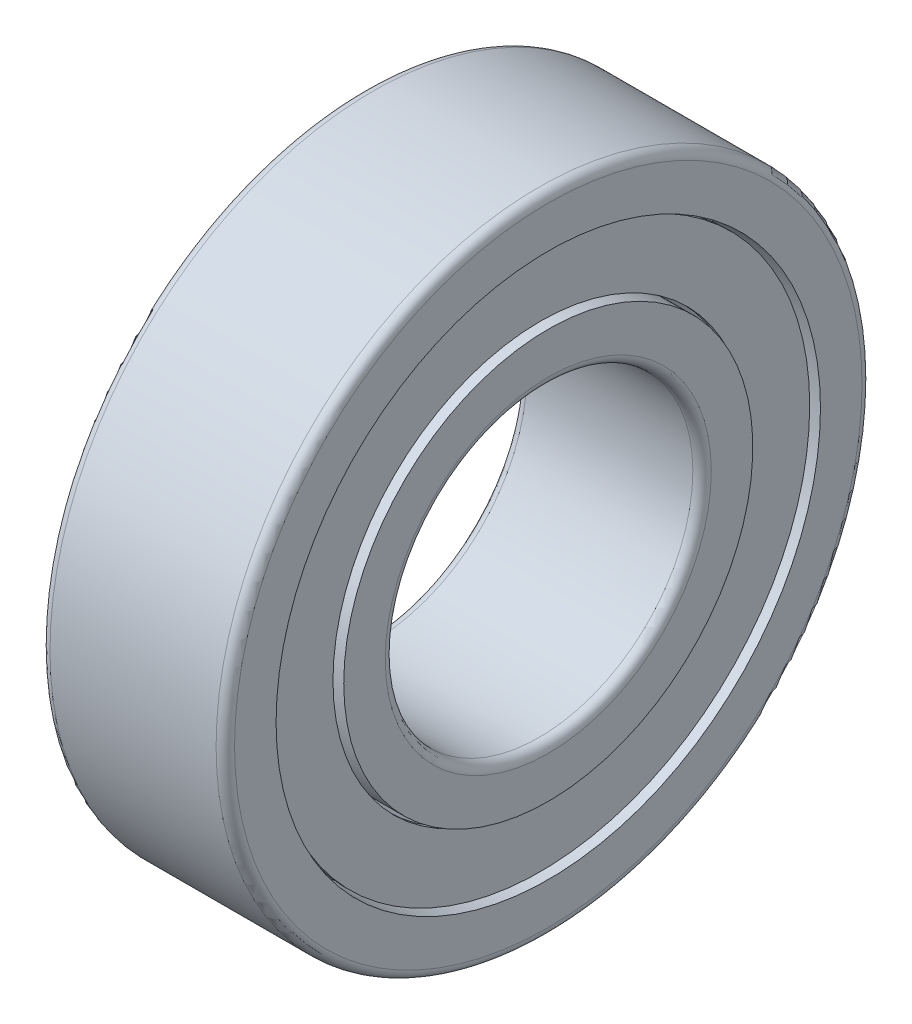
ISO-10303-21;
HEADER;
FILE_DESCRIPTION(('STEP AP214'),'2;1');
FILE_NAME('part.step','',(''),(''),'','','');
FILE_SCHEMA(('AUTOMOTIVE_DESIGN { 1 0 10303 214 1 1 1 1 }'));
ENDSEC;
DATA;
#1=APPLICATION_CONTEXT('core data for automotive mechanical design processes');
#2=APPLICATION_PROTOCOL_DEFINITION('international standard','automotive_design',2000,#1);
#3=PRODUCT_CONTEXT('',#1,'mechanical');
#4=PRODUCT('Part','Part','',(#3));
#5=PRODUCT_RELATED_PRODUCT_CATEGORY('part','',(#4));
#6=PRODUCT_DEFINITION_FORMATION('','',#4);
#7=PRODUCT_DEFINITION_CONTEXT('part definition',#1,'design');
#8=PRODUCT_DEFINITION('design','',#6,#7);
#9=PRODUCT_DEFINITION_SHAPE('','',#8);
#10=(LENGTH_UNIT() NAMED_UNIT(*) SI_UNIT(.MILLI.,.METRE.));
#11=(NAMED_UNIT(*) PLANE_ANGLE_UNIT() SI_UNIT($,.RADIAN.));
#12=(NAMED_UNIT(*) SI_UNIT($,.STERADIAN.) SOLID_ANGLE_UNIT());
#13=UNCERTAINTY_MEASURE_WITH_UNIT(LENGTH_MEASURE(1.E-05),#10,'distance_accuracy_value','');
#14=(GEOMETRIC_REPRESENTATION_CONTEXT(3) GLOBAL_UNCERTAINTY_ASSIGNED_CONTEXT((#13)) GLOBAL_UNIT_ASSIGNED_CONTEXT((#10,
#11,#12)) REPRESENTATION_CONTEXT('',''));
#15=CARTESIAN_POINT('',(0.,0.,0.));
#16=DIRECTION('',(0.,0.,1.));
#17=DIRECTION('',(1.,0.,0.));
#18=AXIS2_PLACEMENT_3D('',#15,#16,#17);
#19=CARTESIAN_POINT('',(6.00000000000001,1.80411241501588E-13,0.));
#20=DIRECTION('',(-1.,0.,0.));
#21=DIRECTION('',(0.,0.,1.00000000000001));
#22=AXIS2_PLACEMENT_3D('',#19,#20,#21);
#23=TOROIDAL_SURFACE('',#22,15.5,3.3);
#24=CARTESIAN_POINT('',(6.00000000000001,1.81454851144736E-13,18.8000000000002));
#25=VERTEX_POINT('',#24);
#26=VERTEX_LOOP('',#25);
#27=FACE_BOUND('',#26,.T.);
#28=ADVANCED_FACE('F40',(#27),#23,.T.);
#29=CLOSED_SHELL('',(#28));
#30=CARTESIAN_POINT('',(6.00000000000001,1.80411241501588E-13,0.));
#31=DIRECTION('',(-1.,0.,0.));
#32=DIRECTION('',(0.,0.,1.00000000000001));
#33=AXIS2_PLACEMENT_3D('',#30,#31,#32);
#34=TOROIDAL_SURFACE('',#33,15.5,3.25);
#35=CARTESIAN_POINT('',(6.00000000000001,1.81452075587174E-13,18.7500000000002));
#36=VERTEX_POINT('',#35);
#37=VERTEX_LOOP('',#36);
#38=FACE_BOUND('',#37,.T.);
#39=ADVANCED_FACE('F53',(#38),#34,.F.);
#40=CLOSED_SHELL('',(#39));
#41=ORIENTED_CLOSED_SHELL('',*,#40,.T.);
#42=BREP_WITH_VOIDS('B2',#29,(#41));
#43=CARTESIAN_POINT('',(0.599999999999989,0.,0.));
#44=DIRECTION('',(-1.,0.,0.));
#45=DIRECTION('',(0.,0.,1.00000000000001));
#46=AXIS2_PLACEMENT_3D('',#43,#44,#45);
#47=TOROIDAL_SURFACE('',#46,20.4,0.600000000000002);
#48=CARTESIAN_POINT('',(0.,0.,0.));
#49=DIRECTION('',(-1.,0.,0.));
#50=DIRECTION('',(0.,0.,1.00000000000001));
#51=AXIS2_PLACEMENT_3D('',#48,#49,#50);
#52=CIRCLE('',#51,20.4);
#53=CARTESIAN_POINT('',(0.,0.,20.4000000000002));
#54=VERTEX_POINT('',#53);
#55=EDGE_CURVE('E38',#54,#54,#52,.T.);
#56=ORIENTED_EDGE('',*,*,#55,.F.);
#57=EDGE_LOOP('',(#56));
#58=FACE_BOUND('',#57,.T.);
#59=CARTESIAN_POINT('',(0.599999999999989,0.,0.));
#60=DIRECTION('',(-1.,0.,0.));
#61=DIRECTION('',(0.,0.,1.00000000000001));
#62=AXIS2_PLACEMENT_3D('',#59,#60,#61);
#63=CIRCLE('',#62,21.);
#64=CARTESIAN_POINT('',(0.599999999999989,0.,21.0000000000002));
#65=VERTEX_POINT('',#64);
#66=EDGE_CURVE('E99',#65,#65,#63,.T.);
#67=ORIENTED_EDGE('',*,*,#66,.T.);
#68=EDGE_LOOP('',(#67));
#69=FACE_BOUND('',#68,.T.);
#70=ADVANCED_FACE('F71',(#58,#69),#47,.T.);
#71=CARTESIAN_POINT('',(0.,0.,-20.4000000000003));
#72=DIRECTION('',(1.,0.,0.));
#73=DIRECTION('',(0.,0.,-1.00000000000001));
#74=AXIS2_PLACEMENT_3D('',#71,#72,#73);
#75=PLANE('',#74);
#76=CARTESIAN_POINT('',(0.,0.,0.));
#77=DIRECTION('',(-1.,0.,0.));
#78=DIRECTION('',(0.,0.,1.00000000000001));
#79=AXIS2_PLACEMENT_3D('',#76,#77,#78);
#80=CIRCLE('',#79,17.7);
#81=CARTESIAN_POINT('',(0.,0.,17.7000000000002));
#82=VERTEX_POINT('',#81);
#83=EDGE_CURVE('E77',#82,#82,#80,.T.);
#84=ORIENTED_EDGE('',*,*,#83,.F.);
#85=EDGE_LOOP('',(#84));
#86=FACE_BOUND('',#85,.T.);
#87=ORIENTED_EDGE('',*,*,#55,.T.);
#88=EDGE_LOOP('',(#87));
#89=FACE_BOUND('',#88,.T.);
#90=ADVANCED_FACE('F136',(#86,#89),#75,.F.);
#91=CARTESIAN_POINT('',(0.,0.,0.));
#92=DIRECTION('',(-1.,0.,0.));
#93=DIRECTION('',(0.,0.,1.00000000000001));
#94=AXIS2_PLACEMENT_3D('',#91,#92,#93);
#95=CYLINDRICAL_SURFACE('',#94,17.7);
#96=CARTESIAN_POINT('',(3.54032522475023,0.,0.));
#97=DIRECTION('',(-1.,0.,0.));
#98=DIRECTION('',(0.,0.,1.00000000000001));
#99=AXIS2_PLACEMENT_3D('',#96,#97,#98);
#100=CIRCLE('',#99,17.7);
#101=CARTESIAN_POINT('',(3.54032522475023,0.,17.7000000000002));
#102=VERTEX_POINT('',#101);
#103=EDGE_CURVE('E81',#102,#102,#100,.T.);
#104=ORIENTED_EDGE('',*,*,#103,.F.);
#105=EDGE_LOOP('',(#104));
#106=FACE_BOUND('',#105,.T.);
#107=ORIENTED_EDGE('',*,*,#83,.T.);
#108=EDGE_LOOP('',(#107));
#109=FACE_BOUND('',#108,.T.);
#110=ADVANCED_FACE('F131',(#106,#109),#95,.F.);
#111=CARTESIAN_POINT('',(6.00000000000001,1.80411241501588E-13,0.));
#112=DIRECTION('',(-1.,0.,0.));
#113=DIRECTION('',(0.,0.,1.00000000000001));
#114=AXIS2_PLACEMENT_3D('',#111,#112,#113);
#115=TOROIDAL_SURFACE('',#114,15.5,3.3);
#116=CARTESIAN_POINT('',(8.45967477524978,0.,1.04083408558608E-13));
#117=DIRECTION('',(-1.,0.,0.));
#118=DIRECTION('',(0.,0.,1.00000000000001));
#119=AXIS2_PLACEMENT_3D('',#116,#117,#118);
#120=CIRCLE('',#119,17.7);
#121=CARTESIAN_POINT('',(8.45967477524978,0.,17.7000000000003));
#122=VERTEX_POINT('',#121);
#123=EDGE_CURVE('E85',#122,#122,#120,.T.);
#124=ORIENTED_EDGE('',*,*,#123,.F.);
#125=EDGE_LOOP('',(#124));
#126=FACE_BOUND('',#125,.T.);
#127=ORIENTED_EDGE('',*,*,#103,.T.);
#128=EDGE_LOOP('',(#127));
#129=FACE_BOUND('',#128,.T.);
#130=ADVANCED_FACE('F125',(#126,#129),#115,.F.);
#131=CARTESIAN_POINT('',(0.,0.,0.));
#132=DIRECTION('',(-1.,0.,0.));
#133=DIRECTION('',(0.,0.,1.00000000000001));
#134=AXIS2_PLACEMENT_3D('',#131,#132,#133);
#135=CYLINDRICAL_SURFACE('',#134,17.7);
#136=CARTESIAN_POINT('',(12.,0.,0.));
#137=DIRECTION('',(-1.,0.,0.));
#138=DIRECTION('',(0.,0.,1.00000000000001));
#139=AXIS2_PLACEMENT_3D('',#136,#137,#138);
#140=CIRCLE('',#139,17.7);
#141=CARTESIAN_POINT('',(12.,0.,17.7000000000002));
#142=VERTEX_POINT('',#141);
#143=EDGE_CURVE('E90',#142,#142,#140,.T.);
#144=ORIENTED_EDGE('',*,*,#143,.F.);
#145=EDGE_LOOP('',(#144));
#146=FACE_BOUND('',#145,.T.);
#147=ORIENTED_EDGE('',*,*,#123,.T.);
#148=EDGE_LOOP('',(#147));
#149=FACE_BOUND('',#148,.T.);
#150=ADVANCED_FACE('F119',(#146,#149),#135,.F.);
#151=CARTESIAN_POINT('',(12.0000000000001,0.,-20.4000000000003));
#152=DIRECTION('',(-1.,0.,0.));
#153=DIRECTION('',(0.,0.,1.00000000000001));
#154=AXIS2_PLACEMENT_3D('',#151,#152,#153);
#155=PLANE('',#154);
#156=CARTESIAN_POINT('',(12.,0.,0.));
#157=DIRECTION('',(-1.,0.,0.));
#158=DIRECTION('',(0.,0.,1.00000000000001));
#159=AXIS2_PLACEMENT_3D('',#156,#157,#158);
#160=CIRCLE('',#159,20.4);
#161=CARTESIAN_POINT('',(12.,0.,20.4000000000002));
#162=VERTEX_POINT('',#161);
#163=EDGE_CURVE('E93',#162,#162,#160,.T.);
#164=ORIENTED_EDGE('',*,*,#163,.F.);
#165=EDGE_LOOP('',(#164));
#166=FACE_BOUND('',#165,.T.);
#167=ORIENTED_EDGE('',*,*,#143,.T.);
#168=EDGE_LOOP('',(#167));
#169=FACE_BOUND('',#168,.T.);
#170=ADVANCED_FACE('F113',(#166,#169),#155,.F.);
#171=CARTESIAN_POINT('',(11.4,0.,0.));
#172=DIRECTION('',(-1.,0.,0.));
#173=DIRECTION('',(0.,0.,1.00000000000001));
#174=AXIS2_PLACEMENT_3D('',#171,#172,#173);
#175=TOROIDAL_SURFACE('',#174,20.4,0.600000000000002);
#176=CARTESIAN_POINT('',(11.4,0.,0.));
#177=DIRECTION('',(-1.,0.,0.));
#178=DIRECTION('',(0.,0.,1.00000000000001));
#179=AXIS2_PLACEMENT_3D('',#176,#177,#178);
#180=CIRCLE('',#179,21.);
#181=CARTESIAN_POINT('',(11.4,0.,21.0000000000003));
#182=VERTEX_POINT('',#181);
#183=EDGE_CURVE('E96',#182,#182,#180,.T.);
#184=ORIENTED_EDGE('',*,*,#183,.F.);
#185=EDGE_LOOP('',(#184));
#186=FACE_BOUND('',#185,.T.);
#187=ORIENTED_EDGE('',*,*,#163,.T.);
#188=EDGE_LOOP('',(#187));
#189=FACE_BOUND('',#188,.T.);
#190=ADVANCED_FACE('F107',(#186,#189),#175,.T.);
#191=CARTESIAN_POINT('',(0.,0.,0.));
#192=DIRECTION('',(-1.,0.,0.));
#193=DIRECTION('',(0.,0.,1.00000000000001));
#194=AXIS2_PLACEMENT_3D('',#191,#192,#193);
#195=CYLINDRICAL_SURFACE('',#194,21.);
#196=ORIENTED_EDGE('',*,*,#66,.F.);
#197=EDGE_LOOP('',(#196));
#198=FACE_BOUND('',#197,.T.);
#199=ORIENTED_EDGE('',*,*,#183,.T.);
#200=EDGE_LOOP('',(#199));
#201=FACE_BOUND('',#200,.T.);
#202=ADVANCED_FACE('F104',(#198,#201),#195,.T.);
#203=CLOSED_SHELL('',(#70,#90,#110,#130,#150,#170,#190,#202));
#204=MANIFOLD_SOLID_BREP('B6',#203);
#205=CARTESIAN_POINT('',(11.2,17.5000000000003,1.59594559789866E-13));
#206=DIRECTION('',(1.,0.,0.));
#207=DIRECTION('',(0.,0.,-1.00000000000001));
#208=AXIS2_PLACEMENT_3D('',#205,#206,#207);
#209=PLANE('',#208);
#210=CARTESIAN_POINT('',(11.2,0.,0.));
#211=DIRECTION('',(-1.,0.,0.));
#212=DIRECTION('',(0.,0.,1.00000000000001));
#213=AXIS2_PLACEMENT_3D('',#210,#211,#212);
#214=CIRCLE('',#213,13.5);
#215=CARTESIAN_POINT('',(11.2,0.,13.5000000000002));
#216=VERTEX_POINT('',#215);
#217=EDGE_CURVE('E70',#216,#216,#214,.T.);
#218=ORIENTED_EDGE('',*,*,#217,.F.);
#219=EDGE_LOOP('',(#218));
#220=FACE_BOUND('',#219,.T.);
#221=CARTESIAN_POINT('',(11.2,0.,0.));
#222=DIRECTION('',(-1.,0.,0.));
#223=DIRECTION('',(0.,0.,1.00000000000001));
#224=AXIS2_PLACEMENT_3D('',#221,#222,#223);
#225=CIRCLE('',#224,17.5);
#226=CARTESIAN_POINT('',(11.2,0.,17.5000000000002));
#227=VERTEX_POINT('',#226);
#228=EDGE_CURVE('E214',#227,#227,#225,.T.);
#229=ORIENTED_EDGE('',*,*,#228,.T.);
#230=EDGE_LOOP('',(#229));
#231=FACE_BOUND('',#230,.T.);
#232=ADVANCED_FACE('F200',(#220,#231),#209,.F.);
#233=CARTESIAN_POINT('',(0.,0.,0.));
#234=DIRECTION('',(-1.,0.,0.));
#235=DIRECTION('',(0.,0.,1.00000000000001));
#236=AXIS2_PLACEMENT_3D('',#233,#234,#235);
#237=CYLINDRICAL_SURFACE('',#236,13.5);
#238=CARTESIAN_POINT('',(11.5,0.,0.));
#239=DIRECTION('',(-1.,0.,0.));
#240=DIRECTION('',(0.,0.,1.00000000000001));
#241=AXIS2_PLACEMENT_3D('',#238,#239,#240);
#242=CIRCLE('',#241,13.5);
#243=CARTESIAN_POINT('',(11.5,0.,13.5000000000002));
#244=VERTEX_POINT('',#243);
#245=EDGE_CURVE('E206',#244,#244,#242,.T.);
#246=ORIENTED_EDGE('',*,*,#245,.F.);
#247=EDGE_LOOP('',(#246));
#248=FACE_BOUND('',#247,.T.);
#249=ORIENTED_EDGE('',*,*,#217,.T.);
#250=EDGE_LOOP('',(#249));
#251=FACE_BOUND('',#250,.T.);
#252=ADVANCED_FACE('F229',(#248,#251),#237,.F.);
#253=CARTESIAN_POINT('',(11.5,17.5000000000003,1.59594559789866E-13));
#254=DIRECTION('',(-1.,0.,0.));
#255=DIRECTION('',(0.,0.,1.00000000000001));
#256=AXIS2_PLACEMENT_3D('',#253,#254,#255);
#257=PLANE('',#256);
#258=CARTESIAN_POINT('',(11.5,0.,0.));
#259=DIRECTION('',(-1.,0.,0.));
#260=DIRECTION('',(0.,0.,1.00000000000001));
#261=AXIS2_PLACEMENT_3D('',#258,#259,#260);
#262=CIRCLE('',#261,17.5);
#263=CARTESIAN_POINT('',(11.5,0.,17.5000000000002));
#264=VERTEX_POINT('',#263);
#265=EDGE_CURVE('E210',#264,#264,#262,.T.);
#266=ORIENTED_EDGE('',*,*,#265,.F.);
#267=EDGE_LOOP('',(#266));
#268=FACE_BOUND('',#267,.T.);
#269=ORIENTED_EDGE('',*,*,#245,.T.);
#270=EDGE_LOOP('',(#269));
#271=FACE_BOUND('',#270,.T.);
#272=ADVANCED_FACE('F224',(#268,#271),#257,.F.);
#273=CARTESIAN_POINT('',(0.,0.,0.));
#274=DIRECTION('',(-1.,0.,0.));
#275=DIRECTION('',(0.,0.,1.00000000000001));
#276=AXIS2_PLACEMENT_3D('',#273,#274,#275);
#277=CYLINDRICAL_SURFACE('',#276,17.5);
#278=ORIENTED_EDGE('',*,*,#228,.F.);
#279=EDGE_LOOP('',(#278));
#280=FACE_BOUND('',#279,.T.);
#281=ORIENTED_EDGE('',*,*,#265,.T.);
#282=EDGE_LOOP('',(#281));
#283=FACE_BOUND('',#282,.T.);
#284=ADVANCED_FACE('F221',(#280,#283),#277,.T.);
#285=CLOSED_SHELL('',(#232,#252,#272,#284));
#286=MANIFOLD_SOLID_BREP('B33',#285);
#287=CARTESIAN_POINT('',(0.5,17.5000000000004,0.));
#288=DIRECTION('',(1.,0.,0.));
#289=DIRECTION('',(0.,0.,-1.00000000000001));
#290=AXIS2_PLACEMENT_3D('',#287,#288,#289);
#291=PLANE('',#290);
#292=CARTESIAN_POINT('',(0.5,0.,0.));
#293=DIRECTION('',(-1.,0.,0.));
#294=DIRECTION('',(0.,0.,1.00000000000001));
#295=AXIS2_PLACEMENT_3D('',#292,#293,#294);
#296=CIRCLE('',#295,13.5);
#297=CARTESIAN_POINT('',(0.5,0.,13.5000000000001));
#298=VERTEX_POINT('',#297);
#299=EDGE_CURVE('E199',#298,#298,#296,.T.);
#300=ORIENTED_EDGE('',*,*,#299,.F.);
#301=EDGE_LOOP('',(#300));
#302=FACE_BOUND('',#301,.T.);
#303=CARTESIAN_POINT('',(0.5,0.,0.));
#304=DIRECTION('',(-1.,0.,0.));
#305=DIRECTION('',(0.,0.,1.00000000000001));
#306=AXIS2_PLACEMENT_3D('',#303,#304,#305);
#307=CIRCLE('',#306,17.5);
#308=CARTESIAN_POINT('',(0.5,0.,17.5000000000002));
#309=VERTEX_POINT('',#308);
#310=EDGE_CURVE('E282',#309,#309,#307,.T.);
#311=ORIENTED_EDGE('',*,*,#310,.T.);
#312=EDGE_LOOP('',(#311));
#313=FACE_BOUND('',#312,.T.);
#314=ADVANCED_FACE('F268',(#302,#313),#291,.F.);
#315=CARTESIAN_POINT('',(0.,0.,0.));
#316=DIRECTION('',(-1.,0.,0.));
#317=DIRECTION('',(0.,0.,1.00000000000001));
#318=AXIS2_PLACEMENT_3D('',#315,#316,#317);
#319=CYLINDRICAL_SURFACE('',#318,13.5);
#320=CARTESIAN_POINT('',(0.800000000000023,0.,0.));
#321=DIRECTION('',(-1.,0.,0.));
#322=DIRECTION('',(0.,0.,1.00000000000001));
#323=AXIS2_PLACEMENT_3D('',#320,#321,#322);
#324=CIRCLE('',#323,13.5);
#325=CARTESIAN_POINT('',(0.800000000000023,0.,13.5000000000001));
#326=VERTEX_POINT('',#325);
#327=EDGE_CURVE('E274',#326,#326,#324,.T.);
#328=ORIENTED_EDGE('',*,*,#327,.F.);
#329=EDGE_LOOP('',(#328));
#330=FACE_BOUND('',#329,.T.);
#331=ORIENTED_EDGE('',*,*,#299,.T.);
#332=EDGE_LOOP('',(#331));
#333=FACE_BOUND('',#332,.T.);
#334=ADVANCED_FACE('F297',(#330,#333),#319,.F.);
#335=CARTESIAN_POINT('',(0.800000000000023,17.5000000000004,0.));
#336=DIRECTION('',(-1.,0.,0.));
#337=DIRECTION('',(0.,0.,1.00000000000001));
#338=AXIS2_PLACEMENT_3D('',#335,#336,#337);
#339=PLANE('',#338);
#340=CARTESIAN_POINT('',(0.800000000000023,0.,0.));
#341=DIRECTION('',(-1.,0.,0.));
#342=DIRECTION('',(0.,0.,1.00000000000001));
#343=AXIS2_PLACEMENT_3D('',#340,#341,#342);
#344=CIRCLE('',#343,17.5);
#345=CARTESIAN_POINT('',(0.800000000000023,0.,17.5000000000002));
#346=VERTEX_POINT('',#345);
#347=EDGE_CURVE('E278',#346,#346,#344,.T.);
#348=ORIENTED_EDGE('',*,*,#347,.F.);
#349=EDGE_LOOP('',(#348));
#350=FACE_BOUND('',#349,.T.);
#351=ORIENTED_EDGE('',*,*,#327,.T.);
#352=EDGE_LOOP('',(#351));
#353=FACE_BOUND('',#352,.T.);
#354=ADVANCED_FACE('F292',(#350,#353),#339,.F.);
#355=CARTESIAN_POINT('',(0.,0.,0.));
#356=DIRECTION('',(-1.,0.,0.));
#357=DIRECTION('',(0.,0.,1.00000000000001));
#358=AXIS2_PLACEMENT_3D('',#355,#356,#357);
#359=CYLINDRICAL_SURFACE('',#358,17.5);
#360=ORIENTED_EDGE('',*,*,#310,.F.);
#361=EDGE_LOOP('',(#360));
#362=FACE_BOUND('',#361,.T.);
#363=ORIENTED_EDGE('',*,*,#347,.T.);
#364=EDGE_LOOP('',(#363));
#365=FACE_BOUND('',#364,.T.);
#366=ADVANCED_FACE('F289',(#362,#365),#359,.T.);
#367=CLOSED_SHELL('',(#314,#334,#354,#366));
#368=MANIFOLD_SOLID_BREP('B65',#367);
#369=CARTESIAN_POINT('',(0.599999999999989,0.,0.));
#370=DIRECTION('',(-1.,0.,0.));
#371=DIRECTION('',(0.,0.,1.00000000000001));
#372=AXIS2_PLACEMENT_3D('',#369,#370,#371);
#373=TOROIDAL_SURFACE('',#372,10.6,0.600000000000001);
#374=CARTESIAN_POINT('',(0.599999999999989,0.,0.));
#375=DIRECTION('',(-1.,0.,0.));
#376=DIRECTION('',(0.,0.,1.00000000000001));
#377=AXIS2_PLACEMENT_3D('',#374,#375,#376);
#378=CIRCLE('',#377,10.);
#379=CARTESIAN_POINT('',(0.599999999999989,0.,10.0000000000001));
#380=VERTEX_POINT('',#379);
#381=EDGE_CURVE('E267',#380,#380,#378,.T.);
#382=ORIENTED_EDGE('',*,*,#381,.F.);
#383=EDGE_LOOP('',(#382));
#384=FACE_BOUND('',#383,.T.);
#385=CARTESIAN_POINT('',(0.,0.,0.));
#386=DIRECTION('',(-1.,0.,0.));
#387=DIRECTION('',(0.,0.,1.00000000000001));
#388=AXIS2_PLACEMENT_3D('',#385,#386,#387);
#389=CIRCLE('',#388,10.6);
#390=CARTESIAN_POINT('',(0.,0.,10.6000000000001));
#391=VERTEX_POINT('',#390);
#392=EDGE_CURVE('E357',#391,#391,#389,.T.);
#393=ORIENTED_EDGE('',*,*,#392,.T.);
#394=EDGE_LOOP('',(#393));
#395=FACE_BOUND('',#394,.T.);
#396=ADVANCED_FACE('F329',(#384,#395),#373,.T.);
#397=CARTESIAN_POINT('',(0.,0.,0.));
#398=DIRECTION('',(-1.,0.,0.));
#399=DIRECTION('',(0.,0.,1.00000000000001));
#400=AXIS2_PLACEMENT_3D('',#397,#398,#399);
#401=CYLINDRICAL_SURFACE('',#400,10.);
#402=CARTESIAN_POINT('',(11.4,0.,0.));
#403=DIRECTION('',(-1.,0.,0.));
#404=DIRECTION('',(0.,0.,1.00000000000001));
#405=AXIS2_PLACEMENT_3D('',#402,#403,#404);
#406=CIRCLE('',#405,10.);
#407=CARTESIAN_POINT('',(11.4,0.,10.0000000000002));
#408=VERTEX_POINT('',#407);
#409=EDGE_CURVE('E335',#408,#408,#406,.T.);
#410=ORIENTED_EDGE('',*,*,#409,.F.);
#411=EDGE_LOOP('',(#410));
#412=FACE_BOUND('',#411,.T.);
#413=ORIENTED_EDGE('',*,*,#381,.T.);
#414=EDGE_LOOP('',(#413));
#415=FACE_BOUND('',#414,.T.);
#416=ADVANCED_FACE('F394',(#412,#415),#401,.F.);
#417=CARTESIAN_POINT('',(11.4,0.,0.));
#418=DIRECTION('',(-1.,0.,0.));
#419=DIRECTION('',(0.,0.,1.00000000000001));
#420=AXIS2_PLACEMENT_3D('',#417,#418,#419);
#421=TOROIDAL_SURFACE('',#420,10.6,0.600000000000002);
#422=CARTESIAN_POINT('',(12.,0.,0.));
#423=DIRECTION('',(-1.,0.,0.));
#424=DIRECTION('',(0.,0.,1.00000000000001));
#425=AXIS2_PLACEMENT_3D('',#422,#423,#424);
#426=CIRCLE('',#425,10.6);
#427=CARTESIAN_POINT('',(12.,0.,10.6000000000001));
#428=VERTEX_POINT('',#427);
#429=EDGE_CURVE('E339',#428,#428,#426,.T.);
#430=ORIENTED_EDGE('',*,*,#429,.F.);
#431=EDGE_LOOP('',(#430));
#432=FACE_BOUND('',#431,.T.);
#433=ORIENTED_EDGE('',*,*,#409,.T.);
#434=EDGE_LOOP('',(#433));
#435=FACE_BOUND('',#434,.T.);
#436=ADVANCED_FACE('F389',(#432,#435),#421,.T.);
#437=CARTESIAN_POINT('',(12.,1.94289029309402E-13,-13.3000000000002));
#438=DIRECTION('',(-1.,0.,0.));
#439=DIRECTION('',(0.,0.,1.00000000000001));
#440=AXIS2_PLACEMENT_3D('',#437,#438,#439);
#441=PLANE('',#440);
#442=CARTESIAN_POINT('',(12.,0.,0.));
#443=DIRECTION('',(-1.,0.,0.));
#444=DIRECTION('',(0.,0.,1.00000000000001));
#445=AXIS2_PLACEMENT_3D('',#442,#443,#444);
#446=CIRCLE('',#445,13.3);
#447=CARTESIAN_POINT('',(12.,0.,13.3000000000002));
#448=VERTEX_POINT('',#447);
#449=EDGE_CURVE('E343',#448,#448,#446,.T.);
#450=ORIENTED_EDGE('',*,*,#449,.F.);
#451=EDGE_LOOP('',(#450));
#452=FACE_BOUND('',#451,.T.);
#453=ORIENTED_EDGE('',*,*,#429,.T.);
#454=EDGE_LOOP('',(#453));
#455=FACE_BOUND('',#454,.T.);
#456=ADVANCED_FACE('F383',(#452,#455),#441,.F.);
#457=CARTESIAN_POINT('',(0.,0.,0.));
#458=DIRECTION('',(-1.,0.,0.));
#459=DIRECTION('',(0.,0.,1.00000000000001));
#460=AXIS2_PLACEMENT_3D('',#457,#458,#459);
#461=CYLINDRICAL_SURFACE('',#460,13.3);
#462=CARTESIAN_POINT('',(8.45967477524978,0.,0.));
#463=DIRECTION('',(-1.,0.,0.));
#464=DIRECTION('',(0.,0.,1.00000000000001));
#465=AXIS2_PLACEMENT_3D('',#462,#463,#464);
#466=CIRCLE('',#465,13.3);
#467=CARTESIAN_POINT('',(8.45967477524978,0.,13.3000000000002));
#468=VERTEX_POINT('',#467);
#469=EDGE_CURVE('E348',#468,#468,#466,.T.);
#470=ORIENTED_EDGE('',*,*,#469,.F.);
#471=EDGE_LOOP('',(#470));
#472=FACE_BOUND('',#471,.T.);
#473=ORIENTED_EDGE('',*,*,#449,.T.);
#474=EDGE_LOOP('',(#473));
#475=FACE_BOUND('',#474,.T.);
#476=ADVANCED_FACE('F377',(#472,#475),#461,.T.);
#477=CARTESIAN_POINT('',(6.00000000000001,2.22044604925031E-13,0.));
#478=DIRECTION('',(-1.,0.,0.));
#479=DIRECTION('',(0.,0.,1.00000000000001));
#480=AXIS2_PLACEMENT_3D('',#477,#478,#479);
#481=TOROIDAL_SURFACE('',#480,15.5,3.3);
#482=CARTESIAN_POINT('',(3.54032522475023,0.,0.));
#483=DIRECTION('',(-1.,0.,0.));
#484=DIRECTION('',(0.,0.,1.00000000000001));
#485=AXIS2_PLACEMENT_3D('',#482,#483,#484);
#486=CIRCLE('',#485,13.3);
#487=CARTESIAN_POINT('',(3.54032522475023,0.,13.3000000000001));
#488=VERTEX_POINT('',#487);
#489=EDGE_CURVE('E351',#488,#488,#486,.T.);
#490=ORIENTED_EDGE('',*,*,#489,.F.);
#491=EDGE_LOOP('',(#490));
#492=FACE_BOUND('',#491,.T.);
#493=ORIENTED_EDGE('',*,*,#469,.T.);
#494=EDGE_LOOP('',(#493));
#495=FACE_BOUND('',#494,.T.);
#496=ADVANCED_FACE('F371',(#492,#495),#481,.F.);
#497=CARTESIAN_POINT('',(0.,0.,0.));
#498=DIRECTION('',(-1.,0.,0.));
#499=DIRECTION('',(0.,0.,1.00000000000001));
#500=AXIS2_PLACEMENT_3D('',#497,#498,#499);
#501=CYLINDRICAL_SURFACE('',#500,13.3);
#502=CARTESIAN_POINT('',(0.,0.,0.));
#503=DIRECTION('',(-1.,0.,0.));
#504=DIRECTION('',(0.,0.,1.00000000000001));
#505=AXIS2_PLACEMENT_3D('',#502,#503,#504);
#506=CIRCLE('',#505,13.3);
#507=CARTESIAN_POINT('',(0.,0.,13.3000000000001));
#508=VERTEX_POINT('',#507);
#509=EDGE_CURVE('E354',#508,#508,#506,.T.);
#510=ORIENTED_EDGE('',*,*,#509,.F.);
#511=EDGE_LOOP('',(#510));
#512=FACE_BOUND('',#511,.T.);
#513=ORIENTED_EDGE('',*,*,#489,.T.);
#514=EDGE_LOOP('',(#513));
#515=FACE_BOUND('',#514,.T.);
#516=ADVANCED_FACE('F365',(#512,#515),#501,.T.);
#517=CARTESIAN_POINT('',(0.,1.38777878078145E-13,-13.3000000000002));
#518=DIRECTION('',(1.,0.,0.));
#519=DIRECTION('',(0.,0.,-1.00000000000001));
#520=AXIS2_PLACEMENT_3D('',#517,#518,#519);
#521=PLANE('',#520);
#522=ORIENTED_EDGE('',*,*,#392,.F.);
#523=EDGE_LOOP('',(#522));
#524=FACE_BOUND('',#523,.T.);
#525=ORIENTED_EDGE('',*,*,#509,.T.);
#526=EDGE_LOOP('',(#525));
#527=FACE_BOUND('',#526,.T.);
#528=ADVANCED_FACE('F362',(#524,#527),#521,.F.);
#529=CLOSED_SHELL('',(#396,#416,#436,#456,#476,#496,#516,#528));
#530=MANIFOLD_SOLID_BREP('B194',#529);
#531=ADVANCED_BREP_SHAPE_REPRESENTATION('',(#18,#42,#204,#286,#368,#530),#14);
#532=SHAPE_DEFINITION_REPRESENTATION(#9,#531);
ENDSEC;
END-ISO-10303-21;
